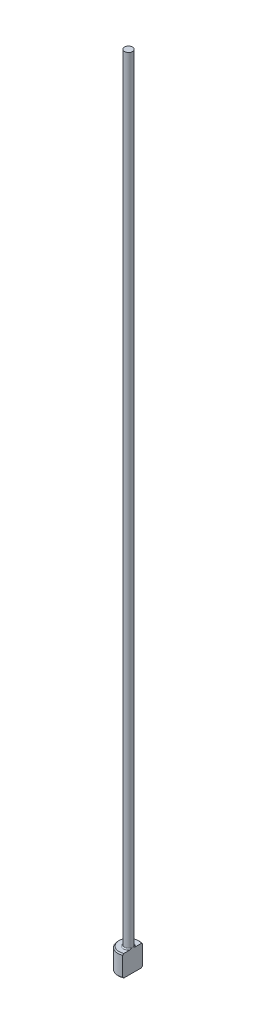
ISO-10303-21;
HEADER;
FILE_DESCRIPTION(('STEP AP214'),'2;1');
FILE_NAME('part.step','',(''),(''),'','','');
FILE_SCHEMA(('AUTOMOTIVE_DESIGN { 1 0 10303 214 1 1 1 1 }'));
ENDSEC;
DATA;
#1=APPLICATION_CONTEXT('core data for automotive mechanical design processes');
#2=APPLICATION_PROTOCOL_DEFINITION('international standard','automotive_design',2000,#1);
#3=PRODUCT_CONTEXT('',#1,'mechanical');
#4=PRODUCT('Part','Part','',(#3));
#5=PRODUCT_RELATED_PRODUCT_CATEGORY('part','',(#4));
#6=PRODUCT_DEFINITION_FORMATION('','',#4);
#7=PRODUCT_DEFINITION_CONTEXT('part definition',#1,'design');
#8=PRODUCT_DEFINITION('design','',#6,#7);
#9=PRODUCT_DEFINITION_SHAPE('','',#8);
#10=(LENGTH_UNIT() NAMED_UNIT(*) SI_UNIT(.MILLI.,.METRE.));
#11=(NAMED_UNIT(*) PLANE_ANGLE_UNIT() SI_UNIT($,.RADIAN.));
#12=(NAMED_UNIT(*) SI_UNIT($,.STERADIAN.) SOLID_ANGLE_UNIT());
#13=UNCERTAINTY_MEASURE_WITH_UNIT(LENGTH_MEASURE(1.E-05),#10,'distance_accuracy_value','');
#14=(GEOMETRIC_REPRESENTATION_CONTEXT(3) GLOBAL_UNCERTAINTY_ASSIGNED_CONTEXT((#13)) GLOBAL_UNIT_ASSIGNED_CONTEXT((#10,
#11,#12)) REPRESENTATION_CONTEXT('',''));
#15=CARTESIAN_POINT('',(0.,0.,0.));
#16=DIRECTION('',(0.,0.,1.));
#17=DIRECTION('',(1.,0.,0.));
#18=AXIS2_PLACEMENT_3D('',#15,#16,#17);
#19=CARTESIAN_POINT('',(0.,0.,0.));
#20=DIRECTION('',(0.,-1.,0.));
#21=DIRECTION('',(0.,0.,-1.));
#22=AXIS2_PLACEMENT_3D('',#19,#20,#21);
#23=PLANE('',#22);
#24=CARTESIAN_POINT('',(0.,0.,0.));
#25=DIRECTION('',(0.,-1.,0.));
#26=DIRECTION('',(0.,0.,-1.));
#27=AXIS2_PLACEMENT_3D('',#24,#25,#26);
#28=CIRCLE('',#27,1.79999999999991);
#29=CARTESIAN_POINT('',(0.749999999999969,0.,1.63630681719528));
#30=VERTEX_POINT('',#29);
#31=CARTESIAN_POINT('',(0.749999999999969,0.,-1.63630681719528));
#32=VERTEX_POINT('',#31);
#33=EDGE_CURVE('E98',#30,#32,#28,.T.);
#34=ORIENTED_EDGE('',*,*,#33,.T.);
#35=DIRECTION('',(0.,0.,1.));
#36=VECTOR('',#35,1.);
#37=CARTESIAN_POINT('',(0.749999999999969,0.,1.85404962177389));
#38=LINE('',#37,#36);
#39=EDGE_CURVE('E83',#32,#30,#38,.T.);
#40=ORIENTED_EDGE('',*,*,#39,.T.);
#41=EDGE_LOOP('',(#34,#40));
#42=FACE_BOUND('',#41,.T.);
#43=ADVANCED_FACE('F32',(#42),#23,.T.);
#44=CARTESIAN_POINT('',(0.,259.958771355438,0.));
#45=DIRECTION('',(0.,1.,0.));
#46=DIRECTION('',(0.,0.,1.));
#47=AXIS2_PLACEMENT_3D('',#44,#45,#46);
#48=CYLINDRICAL_SURFACE('',#47,1.99999999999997);
#49=CARTESIAN_POINT('',(0.,3.79999999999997,0.));
#50=DIRECTION('',(0.,1.,0.));
#51=DIRECTION('',(0.,0.,1.));
#52=AXIS2_PLACEMENT_3D('',#49,#50,#51);
#53=CIRCLE('',#52,1.99999999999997);
#54=CARTESIAN_POINT('',(0.749999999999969,3.79999999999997,1.85404962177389));
#55=VERTEX_POINT('',#54);
#56=CARTESIAN_POINT('',(0.749999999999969,3.79999999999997,-1.85404962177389));
#57=VERTEX_POINT('',#56);
#58=EDGE_CURVE('E104',#55,#57,#53,.F.);
#59=ORIENTED_EDGE('',*,*,#58,.T.);
#60=DIRECTION('',(0.,-1.,0.));
#61=VECTOR('',#60,1.);
#62=CARTESIAN_POINT('',(0.749999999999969,150.,-1.85404962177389));
#63=LINE('',#62,#61);
#64=CARTESIAN_POINT('',(0.749999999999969,0.200000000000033,-1.85404962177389));
#65=VERTEX_POINT('',#64);
#66=EDGE_CURVE('E183',#57,#65,#63,.T.);
#67=ORIENTED_EDGE('',*,*,#66,.T.);
#68=CARTESIAN_POINT('',(0.,0.200000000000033,0.));
#69=DIRECTION('',(0.,-1.,0.));
#70=DIRECTION('',(0.,0.,-1.));
#71=AXIS2_PLACEMENT_3D('',#68,#69,#70);
#72=CIRCLE('',#71,1.99999999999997);
#73=CARTESIAN_POINT('',(0.749999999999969,0.200000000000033,1.85404962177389));
#74=VERTEX_POINT('',#73);
#75=EDGE_CURVE('E100',#65,#74,#72,.F.);
#76=ORIENTED_EDGE('',*,*,#75,.T.);
#77=DIRECTION('',(0.,-1.,0.));
#78=VECTOR('',#77,1.);
#79=CARTESIAN_POINT('',(0.749999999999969,150.,1.85404962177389));
#80=LINE('',#79,#78);
#81=EDGE_CURVE('E93',#55,#74,#80,.T.);
#82=ORIENTED_EDGE('',*,*,#81,.F.);
#83=EDGE_LOOP('',(#59,#67,#76,#82));
#84=FACE_BOUND('',#83,.T.);
#85=ADVANCED_FACE('F158',(#84),#48,.T.);
#86=CARTESIAN_POINT('',(-1.99999999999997,4.,0.));
#87=DIRECTION('',(0.,1.,0.));
#88=DIRECTION('',(0.,0.,1.));
#89=AXIS2_PLACEMENT_3D('',#86,#87,#88);
#90=PLANE('',#89);
#91=CARTESIAN_POINT('',(0.,4.,0.));
#92=DIRECTION('',(0.,1.,0.));
#93=DIRECTION('',(0.,0.,1.));
#94=AXIS2_PLACEMENT_3D('',#91,#92,#93);
#95=CIRCLE('',#94,1.79999999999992);
#96=CARTESIAN_POINT('',(0.749999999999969,4.,-1.63630681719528));
#97=VERTEX_POINT('',#96);
#98=CARTESIAN_POINT('',(0.749999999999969,4.,1.63630681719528));
#99=VERTEX_POINT('',#98);
#100=EDGE_CURVE('E178',#97,#99,#95,.T.);
#101=ORIENTED_EDGE('',*,*,#100,.T.);
#102=DIRECTION('',(0.,0.,-1.));
#103=VECTOR('',#102,1.);
#104=CARTESIAN_POINT('',(0.749999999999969,4.,0.));
#105=LINE('',#104,#103);
#106=CARTESIAN_POINT('',(0.749999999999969,3.99999999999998,0.583095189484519));
#107=VERTEX_POINT('',#106);
#108=EDGE_CURVE('E57',#99,#107,#105,.T.);
#109=ORIENTED_EDGE('',*,*,#108,.T.);
#110=CARTESIAN_POINT('',(0.,4.,0.));
#111=DIRECTION('',(0.,1.,0.));
#112=DIRECTION('',(0.,0.,1.));
#113=AXIS2_PLACEMENT_3D('',#110,#111,#112);
#114=CIRCLE('',#113,0.949999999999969);
#115=CARTESIAN_POINT('',(0.749999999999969,3.99999999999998,-0.583095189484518));
#116=VERTEX_POINT('',#115);
#117=EDGE_CURVE('E107',#107,#116,#114,.F.);
#118=ORIENTED_EDGE('',*,*,#117,.T.);
#119=EDGE_CURVE('E136',#116,#97,#105,.T.);
#120=ORIENTED_EDGE('',*,*,#119,.T.);
#121=EDGE_LOOP('',(#101,#109,#118,#120));
#122=FACE_BOUND('',#121,.T.);
#123=ADVANCED_FACE('F147',(#122),#90,.T.);
#124=CARTESIAN_POINT('',(0.,4.,0.));
#125=DIRECTION('',(0.,-1.,0.));
#126=DIRECTION('',(0.,0.,-1.));
#127=AXIS2_PLACEMENT_3D('',#124,#125,#126);
#128=CONICAL_SURFACE('',#127,1.79999999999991,0.785398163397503);
#129=ORIENTED_EDGE('',*,*,#58,.F.);
#130=CARTESIAN_POINT('',(0.749999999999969,1.64933448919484,4.08234297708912));
#131=CARTESIAN_POINT('',(0.749999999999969,1.7568632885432,3.97300940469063));
#132=CARTESIAN_POINT('',(0.749999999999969,1.86432546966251,3.86361021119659));
#133=CARTESIAN_POINT('',(0.749999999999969,2.07918719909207,3.64450528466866));
#134=CARTESIAN_POINT('',(0.749999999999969,2.18658653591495,3.53479934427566));
#135=CARTESIAN_POINT('',(0.749999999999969,2.40330928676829,3.3129419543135));
#136=CARTESIAN_POINT('',(0.749999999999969,2.51262786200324,3.20078577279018));
#137=CARTESIAN_POINT('',(0.749999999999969,2.73079905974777,2.9762702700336));
#138=CARTESIAN_POINT('',(0.749999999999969,2.83965207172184,2.86391132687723));
#139=CARTESIAN_POINT('',(0.749999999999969,3.12410072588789,2.56910579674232));
#140=CARTESIAN_POINT('',(0.749999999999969,3.29932702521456,2.38630095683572));
#141=CARTESIAN_POINT('',(0.749999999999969,3.56081447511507,2.1100508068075));
#142=CARTESIAN_POINT('',(0.749999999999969,3.64793893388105,2.017423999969));
#143=CARTESIAN_POINT('',(0.749999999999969,3.82126966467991,1.83139888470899));
#144=CARTESIAN_POINT('',(0.749999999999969,3.90747636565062,1.73800097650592));
#145=CARTESIAN_POINT('',(0.749999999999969,4.07705927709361,1.55161637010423));
#146=CARTESIAN_POINT('',(0.749999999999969,4.16045863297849,1.45865087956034));
#147=CARTESIAN_POINT('',(0.749999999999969,4.2839983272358,1.31767418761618));
#148=CARTESIAN_POINT('',(0.749999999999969,4.324956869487,1.27038111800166));
#149=CARTESIAN_POINT('',(0.749999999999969,4.40612814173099,1.17516037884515));
#150=CARTESIAN_POINT('',(0.749999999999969,4.4463409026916,1.12723273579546));
#151=CARTESIAN_POINT('',(0.749999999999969,4.5254229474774,1.03092047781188));
#152=CARTESIAN_POINT('',(0.749999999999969,4.56430041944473,0.982542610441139));
#153=CARTESIAN_POINT('',(0.749999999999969,4.64060877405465,0.884663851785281));
#154=CARTESIAN_POINT('',(0.749999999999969,4.67803993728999,0.835163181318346));
#155=CARTESIAN_POINT('',(0.749999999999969,4.75064212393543,0.734748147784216));
#156=CARTESIAN_POINT('',(0.749999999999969,4.78581957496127,0.68383845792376));
#157=CARTESIAN_POINT('',(0.749999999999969,4.85281471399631,0.579868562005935));
#158=CARTESIAN_POINT('',(0.749999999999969,4.88463648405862,0.526811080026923));
#159=CARTESIAN_POINT('',(0.749999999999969,4.92004236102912,0.460353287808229));
#160=CARTESIAN_POINT('',(0.749999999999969,4.92626425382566,0.448355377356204));
#161=CARTESIAN_POINT('',(0.749999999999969,4.93840821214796,0.424205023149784));
#162=CARTESIAN_POINT('',(0.749999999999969,4.9443301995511,0.41205254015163));
#163=CARTESIAN_POINT('',(0.749999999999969,4.96159246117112,0.375357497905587));
#164=CARTESIAN_POINT('',(0.749999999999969,4.9724305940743,0.350574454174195));
#165=CARTESIAN_POINT('',(0.749999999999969,4.99232429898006,0.300598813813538));
#166=CARTESIAN_POINT('',(0.749999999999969,5.00139743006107,0.275413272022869));
#167=CARTESIAN_POINT('',(0.749999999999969,5.01752532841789,0.224391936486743));
#168=CARTESIAN_POINT('',(0.749999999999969,5.02458006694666,0.198556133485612));
#169=CARTESIAN_POINT('',(0.749999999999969,5.03526259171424,0.150878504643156));
#170=CARTESIAN_POINT('',(0.749999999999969,5.03927292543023,0.129123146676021));
#171=CARTESIAN_POINT('',(0.749999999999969,5.04546996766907,0.085362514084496));
#172=CARTESIAN_POINT('',(0.749999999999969,5.04765728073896,0.0633573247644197));
#173=CARTESIAN_POINT('',(0.749999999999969,5.05127090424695,-0.0027095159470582));
#174=CARTESIAN_POINT('',(0.749999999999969,5.04978253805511,-0.0469656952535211));
#175=CARTESIAN_POINT('',(0.749999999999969,5.03814860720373,-0.143936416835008));
#176=CARTESIAN_POINT('',(0.749999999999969,5.02621240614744,-0.196426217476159));
#177=CARTESIAN_POINT('',(0.749999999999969,5.00214641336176,-0.273272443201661));
#178=CARTESIAN_POINT('',(0.749999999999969,4.99304774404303,-0.298672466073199));
#179=CARTESIAN_POINT('',(0.749999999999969,4.9731746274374,-0.348806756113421));
#180=CARTESIAN_POINT('',(0.749999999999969,4.96240055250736,-0.373541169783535));
#181=CARTESIAN_POINT('',(0.749999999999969,4.92901260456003,-0.444792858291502));
#182=CARTESIAN_POINT('',(0.749999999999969,4.90460879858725,-0.490464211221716));
#183=CARTESIAN_POINT('',(0.749999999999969,4.85261191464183,-0.57997284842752));
#184=CARTESIAN_POINT('',(0.749999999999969,4.82501493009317,-0.623807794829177));
#185=CARTESIAN_POINT('',(0.749999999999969,4.76759807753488,-0.71020964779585));
#186=CARTESIAN_POINT('',(0.749999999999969,4.73777062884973,-0.752771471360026));
#187=CARTESIAN_POINT('',(0.749999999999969,4.67663657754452,-0.836824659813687));
#188=CARTESIAN_POINT('',(0.749999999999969,4.64532962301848,-0.878315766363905));
#189=CARTESIAN_POINT('',(0.749999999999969,4.58120898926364,-0.961064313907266));
#190=CARTESIAN_POINT('',(0.749999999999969,4.54838018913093,-1.00230998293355));
#191=CARTESIAN_POINT('',(0.749999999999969,4.48192435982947,-1.08415466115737));
#192=CARTESIAN_POINT('',(0.749999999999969,4.44829728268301,-1.12475363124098));
#193=CARTESIAN_POINT('',(0.749999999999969,4.34669509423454,-1.24559513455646));
#194=CARTESIAN_POINT('',(0.749999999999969,4.27783379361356,-1.32509096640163));
#195=CARTESIAN_POINT('',(0.749999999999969,4.1024221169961,-1.52396732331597));
#196=CARTESIAN_POINT('',(0.749999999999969,3.99494650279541,-1.64252540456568));
#197=CARTESIAN_POINT('',(0.749999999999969,3.77825048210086,-1.87804575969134));
#198=CARTESIAN_POINT('',(0.749999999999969,3.6690299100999,-1.99500788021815));
#199=CARTESIAN_POINT('',(0.749999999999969,3.44939263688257,-2.22808772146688));
#200=CARTESIAN_POINT('',(0.749999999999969,3.33897457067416,-2.34420415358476));
#201=CARTESIAN_POINT('',(0.749999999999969,3.11746229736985,-2.57577975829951));
#202=CARTESIAN_POINT('',(0.749999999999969,3.00636811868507,-2.69123895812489));
#203=CARTESIAN_POINT('',(0.749999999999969,2.7917128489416,-2.91342601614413));
#204=CARTESIAN_POINT('',(0.749999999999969,2.68818407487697,-3.02018512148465));
#205=CARTESIAN_POINT('',(0.749999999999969,2.48083134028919,-3.23341885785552));
#206=CARTESIAN_POINT('',(0.749999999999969,2.37700737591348,-3.33989348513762));
#207=CARTESIAN_POINT('',(0.749999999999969,2.16930389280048,-3.55245914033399));
#208=CARTESIAN_POINT('',(0.749999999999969,2.06542472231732,-3.65855050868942));
#209=CARTESIAN_POINT('',(0.749999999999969,1.85749599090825,-3.8705627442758));
#210=CARTESIAN_POINT('',(0.749999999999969,1.75344643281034,-3.97648361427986));
#211=CARTESIAN_POINT('',(0.749999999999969,1.64933448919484,-4.08234297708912));
#212=B_SPLINE_CURVE_WITH_KNOTS('',3,(#130,#131,#132,#133,#134,#135,#136,#137,#138,#139,#140,
#141,#142,#143,#144,#145,#146,#147,#148,#149,#150,#151,#152,#153,#154,#155,#156,#157,#158,#159,
#160,#161,#162,#163,#164,#165,#166,#167,#168,#169,#170,#171,#172,#173,#174,#175,#176,#177,#178,
#179,#180,#181,#182,#183,#184,#185,#186,#187,#188,#189,#190,#191,#192,#193,#194,#195,#196,#197,
#198,#199,#200,#201,#202,#203,#204,#205,#206,#207,#208,#209,#210,#211),.UNSPECIFIED.,.F.,.F.,(4,
2,2,2,2,2,2,2,2,2,2,2,2,2,2,2,2,2,2,2,2,2,2,2,2,2,2,2,2,2,2,2,2,2,2,2,2,2,2,2,4),(0.,
0.460050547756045,0.920626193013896,1.3904828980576,1.85980320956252,2.6194588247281,
3.00094349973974,3.38224127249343,3.75689298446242,3.94457922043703,4.13225764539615,
4.31843090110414,4.50456785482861,4.69014785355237,4.87549943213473,4.91604145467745,
4.95659398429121,5.03768920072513,5.11793098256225,5.19817390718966,5.26446717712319,
5.33073845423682,5.46284570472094,5.62332534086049,5.70422568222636,5.7851080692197,
5.94023468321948,6.09555312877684,6.25142580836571,6.40733575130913,6.5654692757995,
6.72361232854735,7.03910022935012,7.51913300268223,7.9992115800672,8.47991142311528,
8.96059120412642,9.40673105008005,9.85287674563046,10.2983160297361,10.7437479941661),.UNSPECIFIED.);
#213=EDGE_CURVE('E135',#55,#99,#212,.T.);
#214=ORIENTED_EDGE('',*,*,#213,.T.);
#215=ORIENTED_EDGE('',*,*,#100,.F.);
#216=EDGE_CURVE('E127',#97,#57,#212,.T.);
#217=ORIENTED_EDGE('',*,*,#216,.T.);
#218=EDGE_LOOP('',(#129,#214,#215,#217));
#219=FACE_BOUND('',#218,.T.);
#220=ADVANCED_FACE('F143',(#219),#128,.T.);
#221=CARTESIAN_POINT('',(0.,0.200000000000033,0.));
#222=DIRECTION('',(0.,1.,0.));
#223=DIRECTION('',(0.,0.,1.));
#224=AXIS2_PLACEMENT_3D('',#221,#222,#223);
#225=CONICAL_SURFACE('',#224,1.99999999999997,0.785398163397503);
#226=ORIENTED_EDGE('',*,*,#75,.F.);
#227=CARTESIAN_POINT('',(0.749999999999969,2.35066551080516,-4.08234297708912));
#228=CARTESIAN_POINT('',(0.749999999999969,2.24313671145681,-3.97300940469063));
#229=CARTESIAN_POINT('',(0.749999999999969,2.13567453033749,-3.86361021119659));
#230=CARTESIAN_POINT('',(0.749999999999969,1.92081280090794,-3.64450528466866));
#231=CARTESIAN_POINT('',(0.749999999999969,1.81341346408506,-3.53479934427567));
#232=CARTESIAN_POINT('',(0.749999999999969,1.59669071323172,-3.3129419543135));
#233=CARTESIAN_POINT('',(0.749999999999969,1.48737213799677,-3.20078577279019));
#234=CARTESIAN_POINT('',(0.749999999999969,1.26920094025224,-2.9762702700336));
#235=CARTESIAN_POINT('',(0.749999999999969,1.16034792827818,-2.86391132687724));
#236=CARTESIAN_POINT('',(0.749999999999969,0.875899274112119,-2.56910579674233));
#237=CARTESIAN_POINT('',(0.749999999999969,0.700672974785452,-2.38630095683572));
#238=CARTESIAN_POINT('',(0.749999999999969,0.439185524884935,-2.11005080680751));
#239=CARTESIAN_POINT('',(0.749999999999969,0.352061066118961,-2.01742399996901));
#240=CARTESIAN_POINT('',(0.749999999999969,0.178730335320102,-1.83139888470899));
#241=CARTESIAN_POINT('',(0.749999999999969,0.0925236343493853,-1.73800097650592));
#242=CARTESIAN_POINT('',(0.749999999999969,-0.0770592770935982,-1.55161637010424));
#243=CARTESIAN_POINT('',(0.749999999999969,-0.160458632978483,-1.45865087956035));
#244=CARTESIAN_POINT('',(0.749999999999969,-0.283998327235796,-1.31767418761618));
#245=CARTESIAN_POINT('',(0.749999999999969,-0.324956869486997,-1.27038111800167));
#246=CARTESIAN_POINT('',(0.749999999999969,-0.406128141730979,-1.17516037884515));
#247=CARTESIAN_POINT('',(0.749999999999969,-0.446340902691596,-1.12723273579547));
#248=CARTESIAN_POINT('',(0.749999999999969,-0.525422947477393,-1.03092047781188));
#249=CARTESIAN_POINT('',(0.749999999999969,-0.564300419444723,-0.982542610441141));
#250=CARTESIAN_POINT('',(0.749999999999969,-0.640608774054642,-0.884663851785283));
#251=CARTESIAN_POINT('',(0.749999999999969,-0.678039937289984,-0.835163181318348));
#252=CARTESIAN_POINT('',(0.749999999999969,-0.750642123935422,-0.734748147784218));
#253=CARTESIAN_POINT('',(0.749999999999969,-0.785819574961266,-0.683838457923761));
#254=CARTESIAN_POINT('',(0.749999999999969,-0.852814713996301,-0.579868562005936));
#255=CARTESIAN_POINT('',(0.749999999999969,-0.884636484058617,-0.526811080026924));
#256=CARTESIAN_POINT('',(0.749999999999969,-0.920042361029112,-0.460353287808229));
#257=CARTESIAN_POINT('',(0.749999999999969,-0.926264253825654,-0.448355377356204));
#258=CARTESIAN_POINT('',(0.749999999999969,-0.938408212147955,-0.424205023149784));
#259=CARTESIAN_POINT('',(0.749999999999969,-0.944330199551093,-0.41205254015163));
#260=CARTESIAN_POINT('',(0.749999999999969,-0.96159246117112,-0.375357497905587));
#261=CARTESIAN_POINT('',(0.749999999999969,-0.972430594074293,-0.350574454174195));
#262=CARTESIAN_POINT('',(0.749999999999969,-0.992324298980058,-0.300598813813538));
#263=CARTESIAN_POINT('',(0.749999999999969,-1.00139743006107,-0.275413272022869));
#264=CARTESIAN_POINT('',(0.749999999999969,-1.01752532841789,-0.224391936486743));
#265=CARTESIAN_POINT('',(0.749999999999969,-1.02458006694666,-0.198556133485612));
#266=CARTESIAN_POINT('',(0.749999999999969,-1.03526259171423,-0.150878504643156));
#267=CARTESIAN_POINT('',(0.749999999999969,-1.03927292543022,-0.129123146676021));
#268=CARTESIAN_POINT('',(0.749999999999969,-1.04546996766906,-0.0853625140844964));
#269=CARTESIAN_POINT('',(0.749999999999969,-1.04765728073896,-0.0633573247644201));
#270=CARTESIAN_POINT('',(0.749999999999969,-1.05127090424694,0.00270951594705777));
#271=CARTESIAN_POINT('',(0.749999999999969,-1.0497825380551,0.0469656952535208));
#272=CARTESIAN_POINT('',(0.749999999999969,-1.03814860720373,0.143936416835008));
#273=CARTESIAN_POINT('',(0.749999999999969,-1.02621240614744,0.19642621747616));
#274=CARTESIAN_POINT('',(0.749999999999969,-1.00214641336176,0.273272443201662));
#275=CARTESIAN_POINT('',(0.749999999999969,-0.993047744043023,0.2986724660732));
#276=CARTESIAN_POINT('',(0.749999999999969,-0.973174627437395,0.348806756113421));
#277=CARTESIAN_POINT('',(0.749999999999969,-0.962400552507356,0.373541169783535));
#278=CARTESIAN_POINT('',(0.749999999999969,-0.929012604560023,0.444792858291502));
#279=CARTESIAN_POINT('',(0.749999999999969,-0.904608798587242,0.490464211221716));
#280=CARTESIAN_POINT('',(0.749999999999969,-0.852611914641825,0.57997284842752));
#281=CARTESIAN_POINT('',(0.749999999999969,-0.825014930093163,0.623807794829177));
#282=CARTESIAN_POINT('',(0.749999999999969,-0.767598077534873,0.71020964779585));
#283=CARTESIAN_POINT('',(0.749999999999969,-0.737770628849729,0.752771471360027));
#284=CARTESIAN_POINT('',(0.749999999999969,-0.676636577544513,0.836824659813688));
#285=CARTESIAN_POINT('',(0.749999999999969,-0.645329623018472,0.878315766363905));
#286=CARTESIAN_POINT('',(0.749999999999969,-0.58120898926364,0.961064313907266));
#287=CARTESIAN_POINT('',(0.749999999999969,-0.548380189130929,1.00230998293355));
#288=CARTESIAN_POINT('',(0.749999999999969,-0.481924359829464,1.08415466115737));
#289=CARTESIAN_POINT('',(0.749999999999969,-0.448297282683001,1.12475363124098));
#290=CARTESIAN_POINT('',(0.749999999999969,-0.346695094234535,1.24559513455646));
#291=CARTESIAN_POINT('',(0.749999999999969,-0.277833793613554,1.32509096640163));
#292=CARTESIAN_POINT('',(0.749999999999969,-0.1024221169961,1.52396732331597));
#293=CARTESIAN_POINT('',(0.749999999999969,0.00505349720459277,1.64252540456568));
#294=CARTESIAN_POINT('',(0.749999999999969,0.221749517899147,1.87804575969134));
#295=CARTESIAN_POINT('',(0.749999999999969,0.330970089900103,1.99500788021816));
#296=CARTESIAN_POINT('',(0.749999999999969,0.550607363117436,2.22808772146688));
#297=CARTESIAN_POINT('',(0.749999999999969,0.661025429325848,2.34420415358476));
#298=CARTESIAN_POINT('',(0.749999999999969,0.882537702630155,2.57577975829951));
#299=CARTESIAN_POINT('',(0.749999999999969,0.993631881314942,2.69123895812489));
#300=CARTESIAN_POINT('',(0.749999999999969,1.2082871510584,2.91342601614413));
#301=CARTESIAN_POINT('',(0.749999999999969,1.31181592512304,3.02018512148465));
#302=CARTESIAN_POINT('',(0.749999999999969,1.51916865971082,3.23341885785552));
#303=CARTESIAN_POINT('',(0.749999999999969,1.62299262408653,3.33989348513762));
#304=CARTESIAN_POINT('',(0.749999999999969,1.83069610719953,3.55245914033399));
#305=CARTESIAN_POINT('',(0.749999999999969,1.93457527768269,3.65855050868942));
#306=CARTESIAN_POINT('',(0.749999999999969,2.14250400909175,3.8705627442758));
#307=CARTESIAN_POINT('',(0.749999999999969,2.24655356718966,3.97648361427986));
#308=CARTESIAN_POINT('',(0.749999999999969,2.35066551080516,4.08234297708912));
#309=B_SPLINE_CURVE_WITH_KNOTS('',3,(#227,#228,#229,#230,#231,#232,#233,#234,#235,#236,#237,
#238,#239,#240,#241,#242,#243,#244,#245,#246,#247,#248,#249,#250,#251,#252,#253,#254,#255,#256,
#257,#258,#259,#260,#261,#262,#263,#264,#265,#266,#267,#268,#269,#270,#271,#272,#273,#274,#275,
#276,#277,#278,#279,#280,#281,#282,#283,#284,#285,#286,#287,#288,#289,#290,#291,#292,#293,#294,
#295,#296,#297,#298,#299,#300,#301,#302,#303,#304,#305,#306,#307,#308),.UNSPECIFIED.,.F.,.F.,(4,
2,2,2,2,2,2,2,2,2,2,2,2,2,2,2,2,2,2,2,2,2,2,2,2,2,2,2,2,2,2,2,2,2,2,2,2,2,2,2,4),(0.,
0.460050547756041,0.92062619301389,1.39048289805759,1.8598032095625,2.61945882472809,
3.00094349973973,3.38224127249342,3.75689298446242,3.94457922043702,4.13225764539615,
4.31843090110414,4.50456785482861,4.69014785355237,4.87549943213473,4.91604145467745,
4.95659398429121,5.03768920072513,5.11793098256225,5.19817390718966,5.26446717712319,
5.33073845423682,5.46284570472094,5.62332534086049,5.70422568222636,5.7851080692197,
5.94023468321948,6.09555312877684,6.25142580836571,6.40733575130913,6.5654692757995,
6.72361232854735,7.03910022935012,7.51913300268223,7.9992115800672,8.47991142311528,
8.96059120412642,9.40673105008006,9.85287674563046,10.2983160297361,10.7437479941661),.UNSPECIFIED.);
#310=EDGE_CURVE('E86',#65,#32,#309,.T.);
#311=ORIENTED_EDGE('',*,*,#310,.T.);
#312=ORIENTED_EDGE('',*,*,#33,.F.);
#313=EDGE_CURVE('E89',#30,#74,#309,.T.);
#314=ORIENTED_EDGE('',*,*,#313,.T.);
#315=EDGE_LOOP('',(#226,#311,#312,#314));
#316=FACE_BOUND('',#315,.T.);
#317=ADVANCED_FACE('F97',(#316),#225,.T.);
#318=CARTESIAN_POINT('',(0.,4.19999999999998,0.));
#319=DIRECTION('',(0.,1.,0.));
#320=DIRECTION('',(0.,0.,1.));
#321=AXIS2_PLACEMENT_3D('',#318,#319,#320);
#322=TOROIDAL_SURFACE('',#321,0.949999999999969,0.2);
#323=CARTESIAN_POINT('',(0.749999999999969,4.19999999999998,0.));
#324=CARTESIAN_POINT('',(0.749999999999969,4.20000052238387,0.));
#325=CARTESIAN_POINT('',(0.749999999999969,4.20000104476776,-7.92518434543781E-08));
#326=CARTESIAN_POINT('',(0.749999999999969,4.20000206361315,-3.453450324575E-07));
#327=CARTESIAN_POINT('',(0.749999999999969,4.20000255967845,-5.33493155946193E-07));
#328=CARTESIAN_POINT('',(0.749999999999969,4.20000354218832,-9.91557928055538E-07));
#329=CARTESIAN_POINT('',(0.749999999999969,4.20000402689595,-1.26510932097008E-06));
#330=CARTESIAN_POINT('',(0.749999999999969,4.20000495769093,-1.86638897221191E-06));
#331=CARTESIAN_POINT('',(0.749999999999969,4.20000540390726,-2.19392467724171E-06));
#332=CARTESIAN_POINT('',(0.749999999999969,4.20000683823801,-3.3337095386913E-06));
#333=CARTESIAN_POINT('',(0.749999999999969,4.20000776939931,-4.21820144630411E-06));
#334=CARTESIAN_POINT('',(0.749999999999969,4.20000948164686,-6.08403167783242E-06));
#335=CARTESIAN_POINT('',(0.749999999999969,4.20001026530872,-7.06314146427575E-06));
#336=CARTESIAN_POINT('',(0.749999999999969,4.20001305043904,-1.07283300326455E-05));
#337=CARTESIAN_POINT('',(0.749999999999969,4.20001489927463,-1.35334971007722E-05));
#338=CARTESIAN_POINT('',(0.749999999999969,4.20001806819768,-1.91887701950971E-05));
#339=CARTESIAN_POINT('',(0.749999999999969,4.20001941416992,-2.20250298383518E-05));
#340=CARTESIAN_POINT('',(0.749999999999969,4.20002483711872,-3.36357626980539E-05));
#341=CARTESIAN_POINT('',(0.749999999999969,4.20002876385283,-4.24755662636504E-05));
#342=CARTESIAN_POINT('',(0.749999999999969,4.20003535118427,-5.93015819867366E-05));
#343=CARTESIAN_POINT('',(0.749999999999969,4.20003811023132,-6.72480837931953E-05));
#344=CARTESIAN_POINT('',(0.749999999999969,4.20005910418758,-0.000122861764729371));
#345=CARTESIAN_POINT('',(0.749999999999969,4.2000847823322,-0.000167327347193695));
#346=CARTESIAN_POINT('',(0.749999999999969,4.20017912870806,-0.00033728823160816));
#347=CARTESIAN_POINT('',(0.749999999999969,4.20024226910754,-0.000465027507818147));
#348=CARTESIAN_POINT('',(0.749999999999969,4.20048606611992,-0.000950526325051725));
#349=CARTESIAN_POINT('',(0.749999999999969,4.20067249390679,-0.00130597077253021));
#350=CARTESIAN_POINT('',(0.749999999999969,4.20141452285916,-0.00272815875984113));
#351=CARTESIAN_POINT('',(0.749999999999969,4.20196367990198,-0.00379745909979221));
#352=CARTESIAN_POINT('',(0.749999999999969,4.21079317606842,-0.0209810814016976));
#353=CARTESIAN_POINT('',(0.749999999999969,4.21912708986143,-0.0370747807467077));
#354=CARTESIAN_POINT('',(0.749999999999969,4.23538169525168,-0.0687945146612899));
#355=CARTESIAN_POINT('',(0.749999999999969,4.24330692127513,-0.0844183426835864));
#356=CARTESIAN_POINT('',(0.749999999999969,4.25980152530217,-0.117412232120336));
#357=CARTESIAN_POINT('',(0.749999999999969,4.2683506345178,-0.134792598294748));
#358=CARTESIAN_POINT('',(0.749999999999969,4.28516256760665,-0.169887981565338));
#359=CARTESIAN_POINT('',(0.749999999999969,4.29342203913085,-0.187604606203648));
#360=CARTESIAN_POINT('',(0.749999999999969,4.31367684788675,-0.232718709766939));
#361=CARTESIAN_POINT('',(0.749999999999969,4.32533268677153,-0.260271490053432));
#362=CARTESIAN_POINT('',(0.749999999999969,4.34666110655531,-0.315501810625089));
#363=CARTESIAN_POINT('',(0.749999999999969,4.35636938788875,-0.343165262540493));
#364=CARTESIAN_POINT('',(0.749999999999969,4.37268127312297,-0.396748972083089));
#365=CARTESIAN_POINT('',(0.749999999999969,4.379483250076,-0.42260763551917));
#366=CARTESIAN_POINT('',(0.749999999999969,4.39076706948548,-0.476103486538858));
#367=CARTESIAN_POINT('',(0.749999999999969,4.39512718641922,-0.503767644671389));
#368=CARTESIAN_POINT('',(0.749999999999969,4.40012258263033,-0.559350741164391));
#369=CARTESIAN_POINT('',(0.749999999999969,4.40077276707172,-0.587268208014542));
#370=CARTESIAN_POINT('',(0.749999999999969,4.39725531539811,-0.642496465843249));
#371=CARTESIAN_POINT('',(0.749999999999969,4.39315871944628,-0.669810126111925));
#372=CARTESIAN_POINT('',(0.749999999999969,4.38226759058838,-0.710376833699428));
#373=CARTESIAN_POINT('',(0.749999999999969,4.37764112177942,-0.724213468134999));
#374=CARTESIAN_POINT('',(0.749999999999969,4.36645438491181,-0.751128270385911));
#375=CARTESIAN_POINT('',(0.749999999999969,4.3598916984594,-0.764205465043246));
#376=CARTESIAN_POINT('',(0.749999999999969,4.34591711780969,-0.787020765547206));
#377=CARTESIAN_POINT('',(0.749999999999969,4.33882518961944,-0.796953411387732));
#378=CARTESIAN_POINT('',(0.749999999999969,4.32312129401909,-0.815534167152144));
#379=CARTESIAN_POINT('',(0.749999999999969,4.31451194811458,-0.824184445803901));
#380=CARTESIAN_POINT('',(0.749999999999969,4.29770708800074,-0.838172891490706));
#381=CARTESIAN_POINT('',(0.749999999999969,4.2897756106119,-0.843827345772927));
#382=CARTESIAN_POINT('',(0.749999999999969,4.27308433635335,-0.853755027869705));
#383=CARTESIAN_POINT('',(0.749999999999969,4.26432487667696,-0.858028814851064));
#384=CARTESIAN_POINT('',(0.749999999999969,4.24611994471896,-0.864966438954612));
#385=CARTESIAN_POINT('',(0.749999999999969,4.23667052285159,-0.86762003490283));
#386=CARTESIAN_POINT('',(0.749999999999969,4.21743927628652,-0.871086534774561));
#387=CARTESIAN_POINT('',(0.749999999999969,4.207657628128,-0.871900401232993));
#388=CARTESIAN_POINT('',(0.749999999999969,4.18916476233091,-0.871644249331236));
#389=CARTESIAN_POINT('',(0.749999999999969,4.18045031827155,-0.870765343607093));
#390=CARTESIAN_POINT('',(0.749999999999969,4.16329782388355,-0.867547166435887));
#391=CARTESIAN_POINT('',(0.749999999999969,4.15485975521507,-0.865207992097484));
#392=CARTESIAN_POINT('',(0.749999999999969,4.138510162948,-0.859212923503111));
#393=CARTESIAN_POINT('',(0.749999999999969,4.13059660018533,-0.855562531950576));
#394=CARTESIAN_POINT('',(0.749999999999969,4.11540880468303,-0.847119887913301));
#395=CARTESIAN_POINT('',(0.749999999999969,4.10813470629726,-0.842327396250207));
#396=CARTESIAN_POINT('',(0.749999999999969,4.09350795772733,-0.831172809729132));
#397=CARTESIAN_POINT('',(0.749999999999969,4.08624574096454,-0.824692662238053));
#398=CARTESIAN_POINT('',(0.749999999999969,4.07268239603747,-0.810794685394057));
#399=CARTESIAN_POINT('',(0.749999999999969,4.06638225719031,-0.803375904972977));
#400=CARTESIAN_POINT('',(0.749999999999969,4.05147186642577,-0.783446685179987));
#401=CARTESIAN_POINT('',(0.749999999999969,4.04355238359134,-0.770417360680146));
#402=CARTESIAN_POINT('',(0.749999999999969,4.02991429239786,-0.743286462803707));
#403=CARTESIAN_POINT('',(0.749999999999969,4.02419651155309,-0.729184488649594));
#404=CARTESIAN_POINT('',(0.749999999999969,4.01257018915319,-0.693822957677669));
#405=CARTESIAN_POINT('',(0.749999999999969,4.00774380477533,-0.672209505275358));
#406=CARTESIAN_POINT('',(0.749999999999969,4.00145191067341,-0.628298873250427));
#407=CARTESIAN_POINT('',(0.749999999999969,4.0000267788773,-0.605996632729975));
#408=CARTESIAN_POINT('',(0.749999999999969,3.99995578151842,-0.54611119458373));
#409=CARTESIAN_POINT('',(0.749999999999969,4.00388309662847,-0.508527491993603));
#410=CARTESIAN_POINT('',(0.749999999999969,4.01373246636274,-0.453837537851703));
#411=CARTESIAN_POINT('',(0.749999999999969,4.01754666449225,-0.436272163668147));
#412=CARTESIAN_POINT('',(0.749999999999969,4.02621031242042,-0.401484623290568));
#413=CARTESIAN_POINT('',(0.749999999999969,4.03105449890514,-0.38426118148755));
#414=CARTESIAN_POINT('',(0.749999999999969,4.04486296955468,-0.339542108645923));
#415=CARTESIAN_POINT('',(0.749999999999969,4.05452531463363,-0.312264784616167));
#416=CARTESIAN_POINT('',(0.749999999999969,4.07570310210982,-0.257776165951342));
#417=CARTESIAN_POINT('',(0.749999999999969,4.08725400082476,-0.230578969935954));
#418=CARTESIAN_POINT('',(0.749999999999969,4.10733071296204,-0.185975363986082));
#419=CARTESIAN_POINT('',(0.749999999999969,4.11553018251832,-0.168419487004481));
#420=CARTESIAN_POINT('',(0.749999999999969,4.13221303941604,-0.133639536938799));
#421=CARTESIAN_POINT('',(0.749999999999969,4.14069316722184,-0.116413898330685));
#422=CARTESIAN_POINT('',(0.749999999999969,4.15705001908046,-0.0837133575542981));
#423=CARTESIAN_POINT('',(0.749999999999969,4.16490699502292,-0.0682284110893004));
#424=CARTESIAN_POINT('',(0.749999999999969,4.18101978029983,-0.0367899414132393));
#425=CARTESIAN_POINT('',(0.749999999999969,4.18928002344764,-0.0208385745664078));
#426=CARTESIAN_POINT('',(0.749999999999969,4.19803632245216,-0.00379745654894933));
#427=CARTESIAN_POINT('',(0.749999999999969,4.19858548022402,-0.00272815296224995));
#428=CARTESIAN_POINT('',(0.749999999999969,4.1993275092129,-0.00130596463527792));
#429=CARTESIAN_POINT('',(0.749999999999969,4.19951393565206,-0.000950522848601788));
#430=CARTESIAN_POINT('',(0.749999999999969,4.19975773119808,-0.000465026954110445));
#431=CARTESIAN_POINT('',(0.749999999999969,4.19982087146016,-0.00033728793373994));
#432=CARTESIAN_POINT('',(0.749999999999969,4.19991521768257,-0.000167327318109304));
#433=CARTESIAN_POINT('',(0.749999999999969,4.19994089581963,-0.000122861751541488));
#434=CARTESIAN_POINT('',(0.749999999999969,4.19996188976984,-6.72480870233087E-05));
#435=CARTESIAN_POINT('',(0.749999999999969,4.19996464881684,-5.93015850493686E-05));
#436=CARTESIAN_POINT('',(0.749999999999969,4.19997123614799,-4.24755688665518E-05));
#437=CARTESIAN_POINT('',(0.749999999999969,4.19997516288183,-3.36357649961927E-05));
#438=CARTESIAN_POINT('',(0.749999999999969,4.19998058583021,-2.20250315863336E-05));
#439=CARTESIAN_POINT('',(0.749999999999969,4.19998193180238,-1.91887717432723E-05));
#440=CARTESIAN_POINT('',(0.749999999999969,4.1999851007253,-1.35334982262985E-05));
#441=CARTESIAN_POINT('',(0.749999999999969,4.19998694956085,-1.07283309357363E-05));
#442=CARTESIAN_POINT('',(0.749999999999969,4.19998973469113,-7.06314207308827E-06));
#443=CARTESIAN_POINT('',(0.749999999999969,4.19999051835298,-6.08403221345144E-06));
#444=CARTESIAN_POINT('',(0.749999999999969,4.19999223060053,-4.21820183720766E-06));
#445=CARTESIAN_POINT('',(0.749999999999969,4.19999316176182,-3.33370985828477E-06));
#446=CARTESIAN_POINT('',(0.749999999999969,4.19999459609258,-2.19392490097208E-06));
#447=CARTESIAN_POINT('',(0.749999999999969,4.19999504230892,-1.86638916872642E-06));
#448=CARTESIAN_POINT('',(0.749999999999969,4.19999597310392,-1.26510946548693E-06));
#449=CARTESIAN_POINT('',(0.749999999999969,4.19999645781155,-9.91558047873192E-07));
#450=CARTESIAN_POINT('',(0.749999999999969,4.19999744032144,-5.33493231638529E-07));
#451=CARTESIAN_POINT('',(0.749999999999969,4.19999793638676,-3.45345088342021E-07));
#452=CARTESIAN_POINT('',(0.749999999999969,4.19999895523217,-7.92518659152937E-08));
#453=CARTESIAN_POINT('',(0.749999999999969,4.19999947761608,0.));
#454=CARTESIAN_POINT('',(0.749999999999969,4.19999999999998,0.));
#455=B_SPLINE_CURVE_WITH_KNOTS('',3,(#323,#324,#325,#326,#327,#328,#329,#330,#331,#332,#333,
#334,#335,#336,#337,#338,#339,#340,#341,#342,#343,#344,#345,#346,#347,#348,#349,#350,#351,#352,
#353,#354,#355,#356,#357,#358,#359,#360,#361,#362,#363,#364,#365,#366,#367,#368,#369,#370,#371,
#372,#373,#374,#375,#376,#377,#378,#379,#380,#381,#382,#383,#384,#385,#386,#387,#388,#389,#390,
#391,#392,#393,#394,#395,#396,#397,#398,#399,#400,#401,#402,#403,#404,#405,#406,#407,#408,#409,
#410,#411,#412,#413,#414,#415,#416,#417,#418,#419,#420,#421,#422,#423,#424,#425,#426,#427,#428,
#429,#430,#431,#432,#433,#434,#435,#436,#437,#438,#439,#440,#441,#442,#443,#444,#445,#446,#447,
#448,#449,#450,#451,#452,#453,#454),.UNSPECIFIED.,.T.,.F.,(4,2,2,2,2,2,2,2,2,2,2,2,2,2,2,2,2,2,
2,2,2,2,2,2,2,2,2,2,2,2,2,2,2,2,2,2,2,2,2,2,2,2,2,2,2,2,2,2,2,2,2,2,2,2,2,2,2,2,2,2,2,2,2,2,2,
4),(0.,1.56543919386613E-06,3.15006544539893E-06,4.81434341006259E-06,6.47280876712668E-06,
1.03067365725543E-05,1.40657946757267E-05,2.41046687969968E-05,3.35140856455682E-05,
6.25197195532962E-05,8.77289705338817E-05,0.000240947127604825,0.000669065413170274,
0.00187238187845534,0.00547938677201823,0.0598417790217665,0.112399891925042,0.170503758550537,
0.229141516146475,0.318850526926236,0.40672395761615,0.486842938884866,0.570663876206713,
0.654147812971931,0.736398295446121,0.780052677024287,0.823761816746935,0.860241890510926,
0.896659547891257,0.925764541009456,0.954857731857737,0.984132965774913,1.01339287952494,
1.03954157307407,1.06568852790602,1.09172701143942,1.11777095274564,1.14686281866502,
1.17598440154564,1.22146737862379,1.26696743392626,1.33303548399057,1.39988404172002,
1.51253340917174,1.56644503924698,1.62008752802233,1.70682485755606,1.79543193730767,
1.85355663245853,1.91115281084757,1.96324672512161,2.0171283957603,2.02073541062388,
2.0219387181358,2.02236683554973,2.02252005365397,2.02254526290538,2.02257426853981,
2.0225836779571,2.02259371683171,2.02259747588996,2.02260130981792,2.02260296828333,
2.02260463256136,2.02260621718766,2.0226077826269),.UNSPECIFIED.);
#456=CARTESIAN_POINT('',(0.749999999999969,4.19999999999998,0.));
#457=VERTEX_POINT('',#456);
#458=EDGE_CURVE('E11',#116,#457,#455,.T.);
#459=ORIENTED_EDGE('',*,*,#458,.F.);
#460=ORIENTED_EDGE('',*,*,#117,.F.);
#461=CARTESIAN_POINT('',(0.749999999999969,4.19999999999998,0.));
#462=CARTESIAN_POINT('',(0.749999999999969,4.19999947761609,0.));
#463=CARTESIAN_POINT('',(0.749999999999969,4.1999989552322,7.92518434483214E-08));
#464=CARTESIAN_POINT('',(0.749999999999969,4.19999793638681,3.45345032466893E-07));
#465=CARTESIAN_POINT('',(0.749999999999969,4.19999744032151,5.33493155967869E-07));
#466=CARTESIAN_POINT('',(0.749999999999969,4.19999645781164,9.91557928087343E-07));
#467=CARTESIAN_POINT('',(0.749999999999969,4.19999597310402,1.26510932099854E-06));
#468=CARTESIAN_POINT('',(0.749999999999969,4.19999504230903,1.86638897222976E-06));
#469=CARTESIAN_POINT('',(0.749999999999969,4.1999945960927,2.19392467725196E-06));
#470=CARTESIAN_POINT('',(0.749999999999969,4.19999316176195,3.33370953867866E-06));
#471=CARTESIAN_POINT('',(0.749999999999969,4.19999223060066,4.21820144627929E-06));
#472=CARTESIAN_POINT('',(0.749999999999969,4.1999905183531,6.08403167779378E-06));
#473=CARTESIAN_POINT('',(0.749999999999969,4.19998973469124,7.06314146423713E-06));
#474=CARTESIAN_POINT('',(0.749999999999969,4.19998694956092,1.07283300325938E-05));
#475=CARTESIAN_POINT('',(0.749999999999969,4.19998510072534,1.35334971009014E-05));
#476=CARTESIAN_POINT('',(0.749999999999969,4.19998193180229,1.91887701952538E-05));
#477=CARTESIAN_POINT('',(0.749999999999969,4.19998058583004,2.20250298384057E-05));
#478=CARTESIAN_POINT('',(0.749999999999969,4.19997516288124,3.36357626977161E-05));
#479=CARTESIAN_POINT('',(0.749999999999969,4.19997123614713,4.24755662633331E-05));
#480=CARTESIAN_POINT('',(0.749999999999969,4.19996464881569,5.93015819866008E-05));
#481=CARTESIAN_POINT('',(0.749999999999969,4.19996188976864,6.72480837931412E-05));
#482=CARTESIAN_POINT('',(0.749999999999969,4.19994089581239,0.000122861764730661));
#483=CARTESIAN_POINT('',(0.749999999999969,4.19991521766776,0.000167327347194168));
#484=CARTESIAN_POINT('',(0.749999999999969,4.19982087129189,0.000337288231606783));
#485=CARTESIAN_POINT('',(0.749999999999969,4.19975773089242,0.000465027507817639));
#486=CARTESIAN_POINT('',(0.749999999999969,4.19951393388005,0.000950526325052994));
#487=CARTESIAN_POINT('',(0.749999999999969,4.19932750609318,0.00130597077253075));
#488=CARTESIAN_POINT('',(0.749999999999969,4.1985854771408,0.00272815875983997));
#489=CARTESIAN_POINT('',(0.749999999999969,4.19803632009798,0.00379745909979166));
#490=CARTESIAN_POINT('',(0.749999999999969,4.18920682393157,0.0209810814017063));
#491=CARTESIAN_POINT('',(0.749999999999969,4.18087291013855,0.037074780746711));
#492=CARTESIAN_POINT('',(0.749999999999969,4.16461830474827,0.0687945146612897));
#493=CARTESIAN_POINT('',(0.749999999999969,4.15669307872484,0.084418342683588));
#494=CARTESIAN_POINT('',(0.749999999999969,4.14019847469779,0.117412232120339));
#495=CARTESIAN_POINT('',(0.749999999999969,4.13164936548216,0.13479259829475));
#496=CARTESIAN_POINT('',(0.749999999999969,4.11483743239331,0.169887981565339));
#497=CARTESIAN_POINT('',(0.749999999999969,4.10657796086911,0.187604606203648));
#498=CARTESIAN_POINT('',(0.749999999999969,4.08632315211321,0.232718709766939));
#499=CARTESIAN_POINT('',(0.749999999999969,4.07466731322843,0.260271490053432));
#500=CARTESIAN_POINT('',(0.749999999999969,4.05333889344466,0.315501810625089));
#501=CARTESIAN_POINT('',(0.749999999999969,4.04363061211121,0.343165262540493));
#502=CARTESIAN_POINT('',(0.749999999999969,4.02731872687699,0.396748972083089));
#503=CARTESIAN_POINT('',(0.749999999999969,4.02051674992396,0.42260763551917));
#504=CARTESIAN_POINT('',(0.749999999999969,4.00923293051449,0.476103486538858));
#505=CARTESIAN_POINT('',(0.749999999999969,4.00487281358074,0.503767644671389));
#506=CARTESIAN_POINT('',(0.749999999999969,3.99987741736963,0.559350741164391));
#507=CARTESIAN_POINT('',(0.749999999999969,3.99922723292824,0.587268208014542));
#508=CARTESIAN_POINT('',(0.749999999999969,4.00274468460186,0.642496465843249));
#509=CARTESIAN_POINT('',(0.749999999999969,4.00684128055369,0.669810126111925));
#510=CARTESIAN_POINT('',(0.749999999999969,4.01773240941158,0.710376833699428));
#511=CARTESIAN_POINT('',(0.749999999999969,4.02235887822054,0.724213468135));
#512=CARTESIAN_POINT('',(0.749999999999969,4.03354561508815,0.751128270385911));
#513=CARTESIAN_POINT('',(0.749999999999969,4.04010830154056,0.764205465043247));
#514=CARTESIAN_POINT('',(0.749999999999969,4.05408288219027,0.787020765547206));
#515=CARTESIAN_POINT('',(0.749999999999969,4.06117481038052,0.796953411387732));
#516=CARTESIAN_POINT('',(0.749999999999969,4.07687870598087,0.815534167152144));
#517=CARTESIAN_POINT('',(0.749999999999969,4.08548805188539,0.824184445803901));
#518=CARTESIAN_POINT('',(0.749999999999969,4.10229291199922,0.838172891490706));
#519=CARTESIAN_POINT('',(0.749999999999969,4.11022438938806,0.843827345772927));
#520=CARTESIAN_POINT('',(0.749999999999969,4.12691566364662,0.853755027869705));
#521=CARTESIAN_POINT('',(0.749999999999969,4.135675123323,0.858028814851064));
#522=CARTESIAN_POINT('',(0.749999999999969,4.153880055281,0.864966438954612));
#523=CARTESIAN_POINT('',(0.749999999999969,4.16332947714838,0.86762003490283));
#524=CARTESIAN_POINT('',(0.749999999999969,4.18256072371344,0.871086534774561));
#525=CARTESIAN_POINT('',(0.749999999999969,4.19234237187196,0.871900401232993));
#526=CARTESIAN_POINT('',(0.749999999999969,4.21083523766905,0.871644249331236));
#527=CARTESIAN_POINT('',(0.749999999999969,4.21954968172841,0.870765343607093));
#528=CARTESIAN_POINT('',(0.749999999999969,4.23670217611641,0.867547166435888));
#529=CARTESIAN_POINT('',(0.749999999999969,4.2451402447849,0.865207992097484));
#530=CARTESIAN_POINT('',(0.749999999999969,4.26148983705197,0.859212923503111));
#531=CARTESIAN_POINT('',(0.749999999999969,4.26940339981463,0.855562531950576));
#532=CARTESIAN_POINT('',(0.749999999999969,4.28459119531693,0.847119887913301));
#533=CARTESIAN_POINT('',(0.749999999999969,4.2918652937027,0.842327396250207));
#534=CARTESIAN_POINT('',(0.749999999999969,4.30649204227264,0.831172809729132));
#535=CARTESIAN_POINT('',(0.749999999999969,4.31375425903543,0.824692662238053));
#536=CARTESIAN_POINT('',(0.749999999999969,4.32731760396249,0.810794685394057));
#537=CARTESIAN_POINT('',(0.749999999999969,4.33361774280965,0.803375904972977));
#538=CARTESIAN_POINT('',(0.749999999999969,4.34852813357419,0.783446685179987));
#539=CARTESIAN_POINT('',(0.749999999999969,4.35644761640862,0.770417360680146));
#540=CARTESIAN_POINT('',(0.749999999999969,4.3700857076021,0.743286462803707));
#541=CARTESIAN_POINT('',(0.749999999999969,4.37580348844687,0.729184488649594));
#542=CARTESIAN_POINT('',(0.749999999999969,4.38742981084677,0.693822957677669));
#543=CARTESIAN_POINT('',(0.749999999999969,4.39225619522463,0.672209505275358));
#544=CARTESIAN_POINT('',(0.749999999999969,4.39854808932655,0.628298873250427));
#545=CARTESIAN_POINT('',(0.749999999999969,4.39997322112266,0.605996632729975));
#546=CARTESIAN_POINT('',(0.749999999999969,4.40004421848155,0.54611119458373));
#547=CARTESIAN_POINT('',(0.749999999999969,4.3961169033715,0.508527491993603));
#548=CARTESIAN_POINT('',(0.749999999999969,4.38626753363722,0.453837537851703));
#549=CARTESIAN_POINT('',(0.749999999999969,4.38245333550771,0.436272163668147));
#550=CARTESIAN_POINT('',(0.749999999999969,4.37378968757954,0.401484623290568));
#551=CARTESIAN_POINT('',(0.749999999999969,4.36894550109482,0.38426118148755));
#552=CARTESIAN_POINT('',(0.749999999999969,4.35513703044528,0.339542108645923));
#553=CARTESIAN_POINT('',(0.749999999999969,4.34547468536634,0.312264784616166));
#554=CARTESIAN_POINT('',(0.749999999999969,4.32429689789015,0.257776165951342));
#555=CARTESIAN_POINT('',(0.749999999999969,4.3127459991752,0.230578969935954));
#556=CARTESIAN_POINT('',(0.749999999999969,4.29266928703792,0.185975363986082));
#557=CARTESIAN_POINT('',(0.749999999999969,4.28446981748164,0.168419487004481));
#558=CARTESIAN_POINT('',(0.749999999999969,4.26778696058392,0.133639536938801));
#559=CARTESIAN_POINT('',(0.749999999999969,4.25930683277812,0.116413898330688));
#560=CARTESIAN_POINT('',(0.749999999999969,4.2429499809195,0.0837133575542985));
#561=CARTESIAN_POINT('',(0.749999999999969,4.23509300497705,0.0682284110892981));
#562=CARTESIAN_POINT('',(0.749999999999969,4.21898021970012,0.0367899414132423));
#563=CARTESIAN_POINT('',(0.749999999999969,4.2107199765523,0.020838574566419));
#564=CARTESIAN_POINT('',(0.749999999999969,4.20196367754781,0.00379745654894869));
#565=CARTESIAN_POINT('',(0.749999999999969,4.20141451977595,0.00272815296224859));
#566=CARTESIAN_POINT('',(0.749999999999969,4.20067249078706,0.00130596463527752));
#567=CARTESIAN_POINT('',(0.749999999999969,4.2004860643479,0.000950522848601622));
#568=CARTESIAN_POINT('',(0.749999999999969,4.20024226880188,0.00046502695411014));
#569=CARTESIAN_POINT('',(0.749999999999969,4.2001791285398,0.000337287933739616));
#570=CARTESIAN_POINT('',(0.749999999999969,4.20008478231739,0.000167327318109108));
#571=CARTESIAN_POINT('',(0.749999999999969,4.20005910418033,0.000122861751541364));
#572=CARTESIAN_POINT('',(0.749999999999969,4.20003811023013,6.72480870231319E-05));
#573=CARTESIAN_POINT('',(0.749999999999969,4.20003535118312,5.93015850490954E-05));
#574=CARTESIAN_POINT('',(0.749999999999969,4.20002876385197,4.24755688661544E-05));
#575=CARTESIAN_POINT('',(0.749999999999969,4.20002483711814,3.36357649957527E-05));
#576=CARTESIAN_POINT('',(0.749999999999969,4.20001941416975,2.20250315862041E-05));
#577=CARTESIAN_POINT('',(0.749999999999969,4.20001806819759,1.91887717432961E-05));
#578=CARTESIAN_POINT('',(0.749999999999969,4.20001489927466,1.35334982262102E-05));
#579=CARTESIAN_POINT('',(0.749999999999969,4.20001305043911,1.07283309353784E-05));
#580=CARTESIAN_POINT('',(0.749999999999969,4.20001026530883,7.06314207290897E-06));
#581=CARTESIAN_POINT('',(0.749999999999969,4.20000948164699,6.0840322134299E-06));
#582=CARTESIAN_POINT('',(0.749999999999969,4.20000776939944,4.21820183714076E-06));
#583=CARTESIAN_POINT('',(0.749999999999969,4.20000683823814,3.33370985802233E-06));
#584=CARTESIAN_POINT('',(0.749999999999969,4.20000540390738,2.1939249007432E-06));
#585=CARTESIAN_POINT('',(0.749999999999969,4.20000495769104,1.8663891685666E-06));
#586=CARTESIAN_POINT('',(0.749999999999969,4.20000402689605,1.26510946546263E-06));
#587=CARTESIAN_POINT('',(0.749999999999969,4.20000354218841,9.91558047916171E-07));
#588=CARTESIAN_POINT('',(0.749999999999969,4.20000255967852,5.33493231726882E-07));
#589=CARTESIAN_POINT('',(0.749999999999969,4.20000206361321,3.45345088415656E-07));
#590=CARTESIAN_POINT('',(0.749999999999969,4.20000104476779,7.92518659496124E-08));
#591=CARTESIAN_POINT('',(0.749999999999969,4.20000052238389,0.));
#592=CARTESIAN_POINT('',(0.749999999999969,4.19999999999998,0.));
#593=B_SPLINE_CURVE_WITH_KNOTS('',3,(#461,#462,#463,#464,#465,#466,#467,#468,#469,#470,#471,
#472,#473,#474,#475,#476,#477,#478,#479,#480,#481,#482,#483,#484,#485,#486,#487,#488,#489,#490,
#491,#492,#493,#494,#495,#496,#497,#498,#499,#500,#501,#502,#503,#504,#505,#506,#507,#508,#509,
#510,#511,#512,#513,#514,#515,#516,#517,#518,#519,#520,#521,#522,#523,#524,#525,#526,#527,#528,
#529,#530,#531,#532,#533,#534,#535,#536,#537,#538,#539,#540,#541,#542,#543,#544,#545,#546,#547,
#548,#549,#550,#551,#552,#553,#554,#555,#556,#557,#558,#559,#560,#561,#562,#563,#564,#565,#566,
#567,#568,#569,#570,#571,#572,#573,#574,#575,#576,#577,#578,#579,#580,#581,#582,#583,#584,#585,
#586,#587,#588,#589,#590,#591,#592),.UNSPECIFIED.,.T.,.F.,(4,2,2,2,2,2,2,2,2,2,2,2,2,2,2,2,2,2,
2,2,2,2,2,2,2,2,2,2,2,2,2,2,2,2,2,2,2,2,2,2,2,2,2,2,2,2,2,2,2,2,2,2,2,2,2,2,2,2,2,2,2,2,2,2,2,
4),(0.,1.5654391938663E-06,3.15006544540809E-06,4.81434341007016E-06,6.4728087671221E-06,
1.03067365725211E-05,1.40657946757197E-05,2.41046687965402E-05,3.35140856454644E-05,
6.25197195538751E-05,8.77289705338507E-05,0.000240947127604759,0.000669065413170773,
0.00187238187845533,0.00547938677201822,0.0598417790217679,0.112399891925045,0.170503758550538,
0.229141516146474,0.318850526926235,0.40672395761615,0.486842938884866,0.570663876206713,
0.654147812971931,0.736398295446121,0.780052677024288,0.823761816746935,0.860241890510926,
0.896659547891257,0.925764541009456,0.954857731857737,0.984132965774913,1.01339287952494,
1.03954157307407,1.06568852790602,1.09172701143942,1.11777095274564,1.14686281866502,
1.17598440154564,1.22146737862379,1.26696743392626,1.33303548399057,1.39988404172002,
1.51253340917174,1.56644503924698,1.62008752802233,1.70682485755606,1.79543193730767,
1.85355663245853,1.91115281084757,1.96324672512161,2.0171283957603,2.02073541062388,
2.0219387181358,2.02236683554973,2.02252005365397,2.02254526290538,2.02257426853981,
2.0225836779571,2.02259371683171,2.02259747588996,2.02260130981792,2.02260296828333,
2.02260463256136,2.02260621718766,2.0226077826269),.UNSPECIFIED.);
#594=EDGE_CURVE('E46',#457,#107,#593,.T.);
#595=ORIENTED_EDGE('',*,*,#594,.F.);
#596=CARTESIAN_POINT('',(0.,4.19999999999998,0.));
#597=DIRECTION('',(0.,1.,0.));
#598=DIRECTION('',(0.,0.,1.));
#599=AXIS2_PLACEMENT_3D('',#596,#597,#598);
#600=CIRCLE('',#599,0.749999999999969);
#601=EDGE_CURVE('E103',#457,#457,#600,.T.);
#602=ORIENTED_EDGE('',*,*,#601,.F.);
#603=EDGE_LOOP('',(#459,#460,#595,#602));
#604=FACE_BOUND('',#603,.T.);
#605=ADVANCED_FACE('F34',(#604),#322,.F.);
#606=CARTESIAN_POINT('',(0.,259.958771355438,0.));
#607=DIRECTION('',(0.,1.,0.));
#608=DIRECTION('',(0.,0.,1.));
#609=AXIS2_PLACEMENT_3D('',#606,#607,#608);
#610=CYLINDRICAL_SURFACE('',#609,0.749999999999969);
#611=ORIENTED_EDGE('',*,*,#601,.T.);
#612=EDGE_LOOP('',(#611));
#613=FACE_BOUND('',#612,.T.);
#614=CARTESIAN_POINT('',(0.,150.,0.));
#615=DIRECTION('',(0.,1.,0.));
#616=DIRECTION('',(0.,0.,1.));
#617=AXIS2_PLACEMENT_3D('',#614,#615,#616);
#618=CIRCLE('',#617,0.749999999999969);
#619=CARTESIAN_POINT('',(0.,150.,0.749999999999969));
#620=VERTEX_POINT('',#619);
#621=EDGE_CURVE('E101',#620,#620,#618,.T.);
#622=ORIENTED_EDGE('',*,*,#621,.F.);
#623=EDGE_LOOP('',(#622));
#624=FACE_BOUND('',#623,.T.);
#625=ADVANCED_FACE('F155',(#613,#624),#610,.T.);
#626=CARTESIAN_POINT('',(-0.749999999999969,150.,0.));
#627=DIRECTION('',(0.,1.,0.));
#628=DIRECTION('',(0.,0.,1.));
#629=AXIS2_PLACEMENT_3D('',#626,#627,#628);
#630=PLANE('',#629);
#631=ORIENTED_EDGE('',*,*,#621,.T.);
#632=EDGE_LOOP('',(#631));
#633=FACE_BOUND('',#632,.T.);
#634=ADVANCED_FACE('F121',(#633),#630,.T.);
#635=CARTESIAN_POINT('',(0.749999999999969,150.,1.85404962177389));
#636=DIRECTION('',(1.,0.,0.));
#637=DIRECTION('',(0.,0.,-1.));
#638=AXIS2_PLACEMENT_3D('',#635,#636,#637);
#639=PLANE('',#638);
#640=ORIENTED_EDGE('',*,*,#66,.F.);
#641=ORIENTED_EDGE('',*,*,#216,.F.);
#642=ORIENTED_EDGE('',*,*,#119,.F.);
#643=ORIENTED_EDGE('',*,*,#458,.T.);
#644=ORIENTED_EDGE('',*,*,#594,.T.);
#645=ORIENTED_EDGE('',*,*,#108,.F.);
#646=ORIENTED_EDGE('',*,*,#213,.F.);
#647=ORIENTED_EDGE('',*,*,#81,.T.);
#648=ORIENTED_EDGE('',*,*,#313,.F.);
#649=ORIENTED_EDGE('',*,*,#39,.F.);
#650=ORIENTED_EDGE('',*,*,#310,.F.);
#651=EDGE_LOOP('',(#640,#641,#642,#643,#644,#645,#646,#647,#648,#649,#650));
#652=FACE_BOUND('',#651,.T.);
#653=ADVANCED_FACE('F85',(#652),#639,.T.);
#654=CLOSED_SHELL('',(#43,#85,#123,#220,#317,#605,#625,#634,#653));
#655=MANIFOLD_SOLID_BREP('B2',#654);
#656=ADVANCED_BREP_SHAPE_REPRESENTATION('',(#18,#655),#14);
#657=SHAPE_DEFINITION_REPRESENTATION(#9,#656);
ENDSEC;
END-ISO-10303-21;
